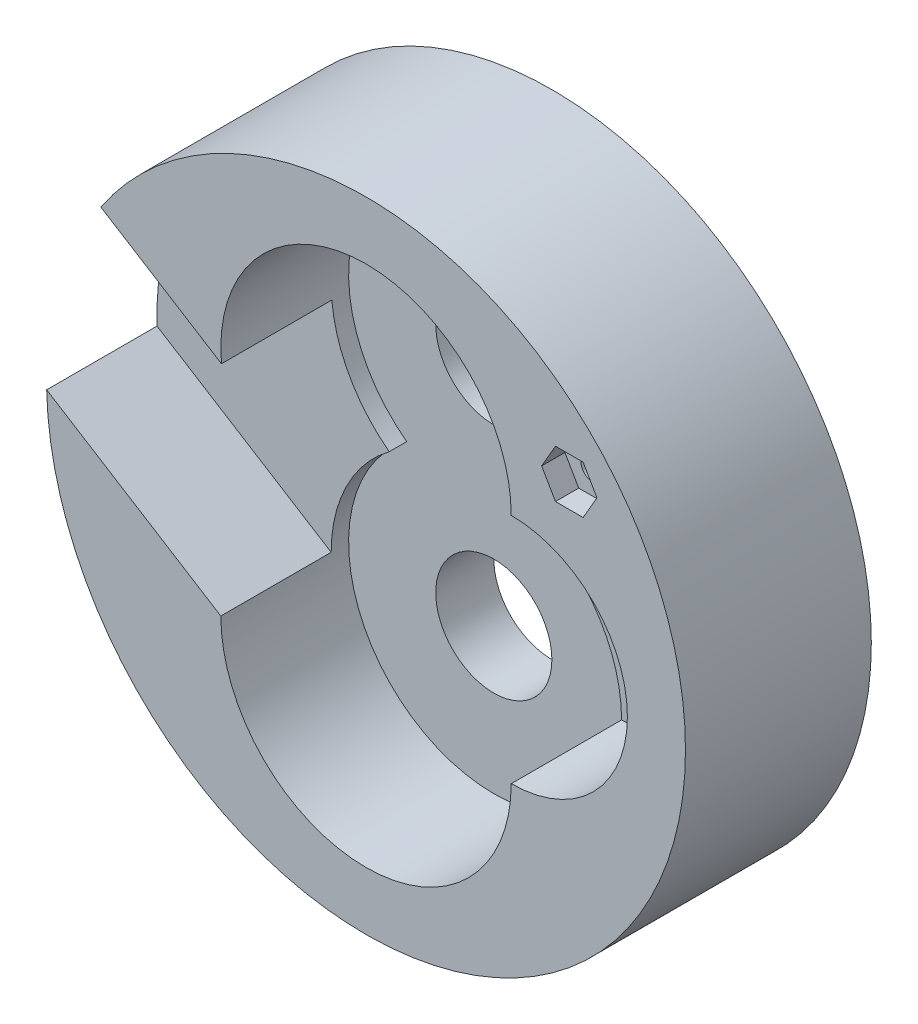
ISO-10303-21;
HEADER;
FILE_DESCRIPTION(('STEP AP214'),'2;1');
FILE_NAME('part.step','',(''),(''),'','','');
FILE_SCHEMA(('AUTOMOTIVE_DESIGN { 1 0 10303 214 1 1 1 1 }'));
ENDSEC;
DATA;
#1=APPLICATION_CONTEXT('core data for automotive mechanical design processes');
#2=APPLICATION_PROTOCOL_DEFINITION('international standard','automotive_design',2000,#1);
#3=PRODUCT_CONTEXT('',#1,'mechanical');
#4=PRODUCT('Part','Part','',(#3));
#5=PRODUCT_RELATED_PRODUCT_CATEGORY('part','',(#4));
#6=PRODUCT_DEFINITION_FORMATION('','',#4);
#7=PRODUCT_DEFINITION_CONTEXT('part definition',#1,'design');
#8=PRODUCT_DEFINITION('design','',#6,#7);
#9=PRODUCT_DEFINITION_SHAPE('','',#8);
#10=(LENGTH_UNIT() NAMED_UNIT(*) SI_UNIT(.MILLI.,.METRE.));
#11=(NAMED_UNIT(*) PLANE_ANGLE_UNIT() SI_UNIT($,.RADIAN.));
#12=(NAMED_UNIT(*) SI_UNIT($,.STERADIAN.) SOLID_ANGLE_UNIT());
#13=UNCERTAINTY_MEASURE_WITH_UNIT(LENGTH_MEASURE(1.E-05),#10,'distance_accuracy_value','');
#14=(GEOMETRIC_REPRESENTATION_CONTEXT(3) GLOBAL_UNCERTAINTY_ASSIGNED_CONTEXT((#13)) GLOBAL_UNIT_ASSIGNED_CONTEXT((#10,
#11,#12)) REPRESENTATION_CONTEXT('',''));
#15=CARTESIAN_POINT('',(0.,0.,0.));
#16=DIRECTION('',(0.,0.,1.));
#17=DIRECTION('',(1.,0.,0.));
#18=AXIS2_PLACEMENT_3D('',#15,#16,#17);
#19=CARTESIAN_POINT('',(0.,20.,-22.));
#20=DIRECTION('',(0.,0.,1.));
#21=DIRECTION('',(1.,0.,0.));
#22=AXIS2_PLACEMENT_3D('',#19,#20,#21);
#23=CYLINDRICAL_SURFACE('',#22,25.);
#24=DIRECTION('',(0.,0.,1.));
#25=VECTOR('',#24,1.);
#26=CARTESIAN_POINT('',(25.,20.,-19.));
#27=LINE('',#26,#25);
#28=CARTESIAN_POINT('',(25.,20.,-19.));
#29=VERTEX_POINT('',#28);
#30=CARTESIAN_POINT('',(25.,20.,0.));
#31=VERTEX_POINT('',#30);
#32=EDGE_CURVE('E196',#29,#31,#27,.T.);
#33=ORIENTED_EDGE('',*,*,#32,.T.);
#34=CARTESIAN_POINT('',(0.,20.,0.));
#35=DIRECTION('',(0.,0.,1.));
#36=DIRECTION('',(1.,0.,0.));
#37=AXIS2_PLACEMENT_3D('',#34,#35,#36);
#38=CIRCLE('',#37,25.);
#39=CARTESIAN_POINT('',(-24.8907586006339,17.6654473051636,0.));
#40=VERTEX_POINT('',#39);
#41=EDGE_CURVE('E241',#31,#40,#38,.T.);
#42=ORIENTED_EDGE('',*,*,#41,.T.);
#43=DIRECTION('',(0.,0.,1.));
#44=VECTOR('',#43,1.);
#45=CARTESIAN_POINT('',(-24.8907586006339,17.6654473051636,-19.));
#46=LINE('',#45,#44);
#47=CARTESIAN_POINT('',(-24.8907586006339,17.6654473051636,-19.));
#48=VERTEX_POINT('',#47);
#49=EDGE_CURVE('E218',#48,#40,#46,.T.);
#50=ORIENTED_EDGE('',*,*,#49,.F.);
#51=CARTESIAN_POINT('',(0.,20.,-19.));
#52=DIRECTION('',(0.,0.,1.));
#53=DIRECTION('',(1.,0.,0.));
#54=AXIS2_PLACEMENT_3D('',#51,#52,#53);
#55=CIRCLE('',#54,25.);
#56=CARTESIAN_POINT('',(-15.,0.,-19.));
#57=VERTEX_POINT('',#56);
#58=EDGE_CURVE('E209',#48,#57,#55,.T.);
#59=ORIENTED_EDGE('',*,*,#58,.T.);
#60=DIRECTION('',(0.,0.,1.));
#61=VECTOR('',#60,1.);
#62=CARTESIAN_POINT('',(-15.,0.,-22.));
#63=LINE('',#62,#61);
#64=CARTESIAN_POINT('',(-15.,0.,-22.));
#65=VERTEX_POINT('',#64);
#66=EDGE_CURVE('E252',#65,#57,#63,.T.);
#67=ORIENTED_EDGE('',*,*,#66,.F.);
#68=CARTESIAN_POINT('',(0.,20.,-22.));
#69=DIRECTION('',(0.,0.,1.));
#70=DIRECTION('',(1.,0.,0.));
#71=AXIS2_PLACEMENT_3D('',#68,#69,#70);
#72=CIRCLE('',#71,25.);
#73=CARTESIAN_POINT('',(15.,0.,-22.));
#74=VERTEX_POINT('',#73);
#75=EDGE_CURVE('E246',#74,#65,#72,.T.);
#76=ORIENTED_EDGE('',*,*,#75,.F.);
#77=DIRECTION('',(0.,0.,1.));
#78=VECTOR('',#77,1.);
#79=CARTESIAN_POINT('',(15.,0.,-22.));
#80=LINE('',#79,#78);
#81=CARTESIAN_POINT('',(15.,0.,-19.));
#82=VERTEX_POINT('',#81);
#83=EDGE_CURVE('E253',#74,#82,#80,.T.);
#84=ORIENTED_EDGE('',*,*,#83,.T.);
#85=CARTESIAN_POINT('',(0.,20.,-19.));
#86=DIRECTION('',(0.,0.,1.));
#87=DIRECTION('',(1.,0.,0.));
#88=AXIS2_PLACEMENT_3D('',#85,#86,#87);
#89=CIRCLE('',#88,25.);
#90=EDGE_CURVE('E51',#82,#29,#89,.T.);
#91=ORIENTED_EDGE('',*,*,#90,.T.);
#92=EDGE_LOOP('',(#33,#42,#50,#59,#67,#76,#84,#91));
#93=FACE_BOUND('',#92,.T.);
#94=ADVANCED_FACE('F28',(#93),#23,.F.);
#95=CARTESIAN_POINT('',(0.,0.,0.));
#96=DIRECTION('',(0.,0.,1.));
#97=DIRECTION('',(1.,0.,0.));
#98=AXIS2_PLACEMENT_3D('',#95,#96,#97);
#99=PLANE('',#98);
#100=DIRECTION('',(1.,0.,0.));
#101=VECTOR('',#100,1.);
#102=CARTESIAN_POINT('',(32.6184301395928,25.875,0.));
#103=LINE('',#102,#101);
#104=CARTESIAN_POINT('',(32.6184301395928,25.875,0.));
#105=VERTEX_POINT('',#104);
#106=CARTESIAN_POINT('',(37.3815698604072,25.875,0.));
#107=VERTEX_POINT('',#106);
#108=EDGE_CURVE('E43',#105,#107,#103,.T.);
#109=ORIENTED_EDGE('',*,*,#108,.F.);
#110=DIRECTION('',(0.500000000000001,-0.866025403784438,0.));
#111=VECTOR('',#110,1.);
#112=CARTESIAN_POINT('',(30.2368602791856,30.,0.));
#113=LINE('',#112,#111);
#114=CARTESIAN_POINT('',(30.2368602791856,30.,0.));
#115=VERTEX_POINT('',#114);
#116=EDGE_CURVE('E161',#115,#105,#113,.T.);
#117=ORIENTED_EDGE('',*,*,#116,.F.);
#118=DIRECTION('',(-0.500000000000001,-0.866025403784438,0.));
#119=VECTOR('',#118,1.);
#120=CARTESIAN_POINT('',(32.6184301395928,34.125,0.));
#121=LINE('',#120,#119);
#122=CARTESIAN_POINT('',(32.6184301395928,34.125,0.));
#123=VERTEX_POINT('',#122);
#124=EDGE_CURVE('E155',#123,#115,#121,.T.);
#125=ORIENTED_EDGE('',*,*,#124,.F.);
#126=DIRECTION('',(-1.,0.,0.));
#127=VECTOR('',#126,1.);
#128=CARTESIAN_POINT('',(37.3815698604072,34.125,0.));
#129=LINE('',#128,#127);
#130=CARTESIAN_POINT('',(37.3815698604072,34.125,0.));
#131=VERTEX_POINT('',#130);
#132=EDGE_CURVE('E153',#131,#123,#129,.T.);
#133=ORIENTED_EDGE('',*,*,#132,.F.);
#134=DIRECTION('',(-0.500000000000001,0.866025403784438,0.));
#135=VECTOR('',#134,1.);
#136=CARTESIAN_POINT('',(39.7631397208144,30.,0.));
#137=LINE('',#136,#135);
#138=CARTESIAN_POINT('',(39.7631397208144,30.,0.));
#139=VERTEX_POINT('',#138);
#140=EDGE_CURVE('E134',#139,#131,#137,.T.);
#141=ORIENTED_EDGE('',*,*,#140,.F.);
#142=DIRECTION('',(0.500000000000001,0.866025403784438,0.));
#143=VECTOR('',#142,1.);
#144=CARTESIAN_POINT('',(37.3815698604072,25.875,0.));
#145=LINE('',#144,#143);
#146=EDGE_CURVE('E145',#107,#139,#145,.T.);
#147=ORIENTED_EDGE('',*,*,#146,.F.);
#148=EDGE_LOOP('',(#109,#117,#125,#133,#141,#147));
#149=FACE_BOUND('',#148,.T.);
#150=ORIENTED_EDGE('',*,*,#41,.F.);
#151=CARTESIAN_POINT('',(25.,0.,0.));
#152=DIRECTION('',(0.,0.,1.));
#153=DIRECTION('',(1.,0.,0.));
#154=AXIS2_PLACEMENT_3D('',#151,#152,#153);
#155=CIRCLE('',#154,20.);
#156=CARTESIAN_POINT('',(25.,-20.,0.));
#157=VERTEX_POINT('',#156);
#158=EDGE_CURVE('E181',#31,#157,#155,.F.);
#159=ORIENTED_EDGE('',*,*,#158,.T.);
#160=CARTESIAN_POINT('',(0.,-20.,0.));
#161=DIRECTION('',(0.,0.,1.));
#162=DIRECTION('',(1.,0.,0.));
#163=AXIS2_PLACEMENT_3D('',#160,#161,#162);
#164=CIRCLE('',#163,25.);
#165=CARTESIAN_POINT('',(-25.,-20.,0.));
#166=VERTEX_POINT('',#165);
#167=EDGE_CURVE('E243',#166,#157,#164,.T.);
#168=ORIENTED_EDGE('',*,*,#167,.F.);
#169=DIRECTION('',(0.848048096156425,-0.529919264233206,0.));
#170=VECTOR('',#169,1.);
#171=CARTESIAN_POINT('',(38.4322930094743,-59.6368958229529,0.));
#172=LINE('',#171,#170);
#173=CARTESIAN_POINT('',(-54.9854969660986,-1.26298194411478,0.));
#174=VERTEX_POINT('',#173);
#175=EDGE_CURVE('E204',#174,#166,#172,.T.);
#176=ORIENTED_EDGE('',*,*,#175,.F.);
#177=CARTESIAN_POINT('',(0.,0.,0.));
#178=DIRECTION('',(0.,0.,1.));
#179=DIRECTION('',(1.,0.,0.));
#180=AXIS2_PLACEMENT_3D('',#177,#178,#179);
#181=CIRCLE('',#180,55.);
#182=CARTESIAN_POINT('',(-45.6687921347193,30.6490036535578,0.));
#183=VERTEX_POINT('',#182);
#184=EDGE_CURVE('E36',#174,#183,#181,.T.);
#185=ORIENTED_EDGE('',*,*,#184,.T.);
#186=DIRECTION('',(0.848048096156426,-0.529919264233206,0.));
#187=VECTOR('',#186,1.);
#188=CARTESIAN_POINT('',(55.3897094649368,-32.4993567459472,0.));
#189=LINE('',#188,#187);
#190=EDGE_CURVE('E199',#183,#40,#189,.T.);
#191=ORIENTED_EDGE('',*,*,#190,.T.);
#192=EDGE_LOOP('',(#150,#159,#168,#176,#185,#191));
#193=FACE_BOUND('',#192,.T.);
#194=ADVANCED_FACE('F149',(#149,#193),#99,.T.);
#195=CARTESIAN_POINT('',(0.,-20.,-22.));
#196=DIRECTION('',(0.,0.,1.));
#197=DIRECTION('',(1.,0.,0.));
#198=AXIS2_PLACEMENT_3D('',#195,#196,#197);
#199=CYLINDRICAL_SURFACE('',#198,25.);
#200=DIRECTION('',(0.,0.,1.));
#201=VECTOR('',#200,1.);
#202=CARTESIAN_POINT('',(25.,-20.,-19.));
#203=LINE('',#202,#201);
#204=CARTESIAN_POINT('',(25.,-20.,-19.));
#205=VERTEX_POINT('',#204);
#206=EDGE_CURVE('E197',#205,#157,#203,.T.);
#207=ORIENTED_EDGE('',*,*,#206,.F.);
#208=CARTESIAN_POINT('',(0.,-20.,-19.));
#209=DIRECTION('',(0.,0.,1.));
#210=DIRECTION('',(1.,0.,0.));
#211=AXIS2_PLACEMENT_3D('',#208,#209,#210);
#212=CIRCLE('',#211,25.);
#213=EDGE_CURVE('E194',#205,#82,#212,.T.);
#214=ORIENTED_EDGE('',*,*,#213,.T.);
#215=ORIENTED_EDGE('',*,*,#83,.F.);
#216=CARTESIAN_POINT('',(0.,-20.,-22.));
#217=DIRECTION('',(0.,0.,1.));
#218=DIRECTION('',(1.,0.,0.));
#219=AXIS2_PLACEMENT_3D('',#216,#217,#218);
#220=CIRCLE('',#219,25.);
#221=EDGE_CURVE('E249',#65,#74,#220,.T.);
#222=ORIENTED_EDGE('',*,*,#221,.F.);
#223=ORIENTED_EDGE('',*,*,#66,.T.);
#224=CARTESIAN_POINT('',(0.,-20.,-19.));
#225=DIRECTION('',(0.,0.,1.));
#226=DIRECTION('',(1.,0.,0.));
#227=AXIS2_PLACEMENT_3D('',#224,#225,#226);
#228=CIRCLE('',#227,25.);
#229=CARTESIAN_POINT('',(-25.,-20.,-19.));
#230=VERTEX_POINT('',#229);
#231=EDGE_CURVE('E206',#57,#230,#228,.T.);
#232=ORIENTED_EDGE('',*,*,#231,.T.);
#233=DIRECTION('',(0.,0.,1.));
#234=VECTOR('',#233,1.);
#235=CARTESIAN_POINT('',(-25.,-20.,-19.));
#236=LINE('',#235,#234);
#237=EDGE_CURVE('E219',#230,#166,#236,.T.);
#238=ORIENTED_EDGE('',*,*,#237,.T.);
#239=ORIENTED_EDGE('',*,*,#167,.T.);
#240=EDGE_LOOP('',(#207,#214,#215,#222,#223,#232,#238,#239));
#241=FACE_BOUND('',#240,.T.);
#242=ADVANCED_FACE('F278',(#241),#199,.F.);
#243=CARTESIAN_POINT('',(0.,0.,-32.));
#244=DIRECTION('',(0.,0.,1.));
#245=DIRECTION('',(1.,0.,0.));
#246=AXIS2_PLACEMENT_3D('',#243,#244,#245);
#247=CYLINDRICAL_SURFACE('',#246,55.);
#248=DIRECTION('',(0.,0.,1.));
#249=VECTOR('',#248,1.);
#250=CARTESIAN_POINT('',(-54.9854969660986,-1.26298194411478,-19.));
#251=LINE('',#250,#249);
#252=CARTESIAN_POINT('',(-54.9854969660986,-1.26298194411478,-19.));
#253=VERTEX_POINT('',#252);
#254=EDGE_CURVE('E223',#253,#174,#251,.T.);
#255=ORIENTED_EDGE('',*,*,#254,.F.);
#256=CARTESIAN_POINT('',(0.,0.,-19.));
#257=DIRECTION('',(0.,0.,1.));
#258=DIRECTION('',(1.,0.,0.));
#259=AXIS2_PLACEMENT_3D('',#256,#257,#258);
#260=CIRCLE('',#259,55.);
#261=CARTESIAN_POINT('',(-45.6687921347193,30.6490036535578,-19.));
#262=VERTEX_POINT('',#261);
#263=EDGE_CURVE('E214',#262,#253,#260,.T.);
#264=ORIENTED_EDGE('',*,*,#263,.F.);
#265=DIRECTION('',(0.,0.,1.));
#266=VECTOR('',#265,1.);
#267=CARTESIAN_POINT('',(-45.6687921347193,30.6490036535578,-19.));
#268=LINE('',#267,#266);
#269=EDGE_CURVE('E225',#262,#183,#268,.T.);
#270=ORIENTED_EDGE('',*,*,#269,.T.);
#271=ORIENTED_EDGE('',*,*,#184,.F.);
#272=EDGE_LOOP('',(#255,#264,#270,#271));
#273=FACE_BOUND('',#272,.T.);
#274=CARTESIAN_POINT('',(0.,0.,-32.));
#275=DIRECTION('',(0.,0.,1.));
#276=DIRECTION('',(1.,0.,0.));
#277=AXIS2_PLACEMENT_3D('',#274,#275,#276);
#278=CIRCLE('',#277,55.);
#279=CARTESIAN_POINT('',(55.,0.,-32.));
#280=VERTEX_POINT('',#279);
#281=EDGE_CURVE('E11',#280,#280,#278,.T.);
#282=ORIENTED_EDGE('',*,*,#281,.T.);
#283=EDGE_LOOP('',(#282));
#284=FACE_BOUND('',#283,.T.);
#285=ADVANCED_FACE('F30',(#273,#284),#247,.T.);
#286=CARTESIAN_POINT('',(0.,0.,-32.));
#287=DIRECTION('',(0.,0.,1.));
#288=DIRECTION('',(1.,0.,0.));
#289=AXIS2_PLACEMENT_3D('',#286,#287,#288);
#290=PLANE('',#289);
#291=CARTESIAN_POINT('',(35.,30.,-32.));
#292=DIRECTION('',(0.,0.,1.));
#293=DIRECTION('',(1.,0.,0.));
#294=AXIS2_PLACEMENT_3D('',#291,#292,#293);
#295=CIRCLE('',#294,2.);
#296=CARTESIAN_POINT('',(37.,30.,-32.));
#297=VERTEX_POINT('',#296);
#298=EDGE_CURVE('E317',#297,#297,#295,.T.);
#299=ORIENTED_EDGE('',*,*,#298,.T.);
#300=EDGE_LOOP('',(#299));
#301=FACE_BOUND('',#300,.T.);
#302=CARTESIAN_POINT('',(0.,-20.,-32.));
#303=DIRECTION('',(0.,0.,1.));
#304=DIRECTION('',(1.,0.,0.));
#305=AXIS2_PLACEMENT_3D('',#302,#303,#304);
#306=CIRCLE('',#305,10.);
#307=CARTESIAN_POINT('',(10.,-20.,-32.));
#308=VERTEX_POINT('',#307);
#309=EDGE_CURVE('E222',#308,#308,#306,.T.);
#310=ORIENTED_EDGE('',*,*,#309,.T.);
#311=EDGE_LOOP('',(#310));
#312=FACE_BOUND('',#311,.T.);
#313=CARTESIAN_POINT('',(0.,20.,-32.));
#314=DIRECTION('',(0.,0.,1.));
#315=DIRECTION('',(1.,0.,0.));
#316=AXIS2_PLACEMENT_3D('',#313,#314,#315);
#317=CIRCLE('',#316,10.);
#318=CARTESIAN_POINT('',(10.,20.,-32.));
#319=VERTEX_POINT('',#318);
#320=EDGE_CURVE('E235',#319,#319,#317,.T.);
#321=ORIENTED_EDGE('',*,*,#320,.T.);
#322=EDGE_LOOP('',(#321));
#323=FACE_BOUND('',#322,.T.);
#324=ORIENTED_EDGE('',*,*,#281,.F.);
#325=EDGE_LOOP('',(#324));
#326=FACE_BOUND('',#325,.T.);
#327=ADVANCED_FACE('F304',(#301,#312,#323,#326),#290,.F.);
#328=CARTESIAN_POINT('',(0.,-121.141421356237,-22.));
#329=DIRECTION('',(0.,0.,1.));
#330=DIRECTION('',(1.,0.,0.));
#331=AXIS2_PLACEMENT_3D('',#328,#329,#330);
#332=PLANE('',#331);
#333=CARTESIAN_POINT('',(0.,-20.,-22.));
#334=DIRECTION('',(0.,0.,1.));
#335=DIRECTION('',(1.,0.,0.));
#336=AXIS2_PLACEMENT_3D('',#333,#334,#335);
#337=CIRCLE('',#336,10.);
#338=CARTESIAN_POINT('',(10.,-20.,-22.));
#339=VERTEX_POINT('',#338);
#340=EDGE_CURVE('E232',#339,#339,#337,.T.);
#341=ORIENTED_EDGE('',*,*,#340,.F.);
#342=EDGE_LOOP('',(#341));
#343=FACE_BOUND('',#342,.T.);
#344=CARTESIAN_POINT('',(0.,20.,-22.));
#345=DIRECTION('',(0.,0.,1.));
#346=DIRECTION('',(1.,0.,0.));
#347=AXIS2_PLACEMENT_3D('',#344,#345,#346);
#348=CIRCLE('',#347,10.);
#349=CARTESIAN_POINT('',(10.,20.,-22.));
#350=VERTEX_POINT('',#349);
#351=EDGE_CURVE('E238',#350,#350,#348,.T.);
#352=ORIENTED_EDGE('',*,*,#351,.F.);
#353=EDGE_LOOP('',(#352));
#354=FACE_BOUND('',#353,.T.);
#355=ORIENTED_EDGE('',*,*,#75,.T.);
#356=ORIENTED_EDGE('',*,*,#221,.T.);
#357=EDGE_LOOP('',(#355,#356));
#358=FACE_BOUND('',#357,.T.);
#359=ADVANCED_FACE('F306',(#343,#354,#358),#332,.T.);
#360=CARTESIAN_POINT('',(0.,20.,-32.));
#361=DIRECTION('',(0.,0.,1.));
#362=DIRECTION('',(1.,0.,0.));
#363=AXIS2_PLACEMENT_3D('',#360,#361,#362);
#364=CYLINDRICAL_SURFACE('',#363,10.);
#365=ORIENTED_EDGE('',*,*,#351,.T.);
#366=EDGE_LOOP('',(#365));
#367=FACE_BOUND('',#366,.T.);
#368=ORIENTED_EDGE('',*,*,#320,.F.);
#369=EDGE_LOOP('',(#368));
#370=FACE_BOUND('',#369,.T.);
#371=ADVANCED_FACE('F291',(#367,#370),#364,.F.);
#372=CARTESIAN_POINT('',(0.,-20.,-32.));
#373=DIRECTION('',(0.,0.,1.));
#374=DIRECTION('',(1.,0.,0.));
#375=AXIS2_PLACEMENT_3D('',#372,#373,#374);
#376=CYLINDRICAL_SURFACE('',#375,10.);
#377=ORIENTED_EDGE('',*,*,#340,.T.);
#378=EDGE_LOOP('',(#377));
#379=FACE_BOUND('',#378,.T.);
#380=ORIENTED_EDGE('',*,*,#309,.F.);
#381=EDGE_LOOP('',(#380));
#382=FACE_BOUND('',#381,.T.);
#383=ADVANCED_FACE('F283',(#379,#382),#376,.F.);
#384=CARTESIAN_POINT('',(38.4322930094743,-59.6368958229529,-19.));
#385=DIRECTION('',(-0.529919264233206,-0.848048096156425,0.));
#386=DIRECTION('',(0.848048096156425,-0.529919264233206,0.));
#387=AXIS2_PLACEMENT_3D('',#384,#385,#386);
#388=PLANE('',#387);
#389=ORIENTED_EDGE('',*,*,#175,.T.);
#390=ORIENTED_EDGE('',*,*,#237,.F.);
#391=DIRECTION('',(0.848048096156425,-0.529919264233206,0.));
#392=VECTOR('',#391,1.);
#393=CARTESIAN_POINT('',(38.4322930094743,-59.6368958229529,-19.));
#394=LINE('',#393,#392);
#395=EDGE_CURVE('E216',#253,#230,#394,.T.);
#396=ORIENTED_EDGE('',*,*,#395,.F.);
#397=ORIENTED_EDGE('',*,*,#254,.T.);
#398=EDGE_LOOP('',(#389,#390,#396,#397));
#399=FACE_BOUND('',#398,.T.);
#400=ADVANCED_FACE('F281',(#399),#388,.F.);
#401=CARTESIAN_POINT('',(55.3897094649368,-32.4993567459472,-19.));
#402=DIRECTION('',(-0.529919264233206,-0.848048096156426,0.));
#403=DIRECTION('',(0.848048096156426,-0.529919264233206,0.));
#404=AXIS2_PLACEMENT_3D('',#401,#402,#403);
#405=PLANE('',#404);
#406=ORIENTED_EDGE('',*,*,#190,.F.);
#407=ORIENTED_EDGE('',*,*,#269,.F.);
#408=DIRECTION('',(0.848048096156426,-0.529919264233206,0.));
#409=VECTOR('',#408,1.);
#410=CARTESIAN_POINT('',(55.3897094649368,-32.4993567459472,-19.));
#411=LINE('',#410,#409);
#412=EDGE_CURVE('E212',#262,#48,#411,.T.);
#413=ORIENTED_EDGE('',*,*,#412,.T.);
#414=ORIENTED_EDGE('',*,*,#49,.T.);
#415=EDGE_LOOP('',(#406,#407,#413,#414));
#416=FACE_BOUND('',#415,.T.);
#417=ADVANCED_FACE('F268',(#416),#405,.T.);
#418=CARTESIAN_POINT('',(0.,-121.141421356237,-19.));
#419=DIRECTION('',(0.,0.,1.));
#420=DIRECTION('',(1.,0.,0.));
#421=AXIS2_PLACEMENT_3D('',#418,#419,#420);
#422=PLANE('',#421);
#423=ORIENTED_EDGE('',*,*,#231,.F.);
#424=ORIENTED_EDGE('',*,*,#58,.F.);
#425=ORIENTED_EDGE('',*,*,#412,.F.);
#426=ORIENTED_EDGE('',*,*,#263,.T.);
#427=ORIENTED_EDGE('',*,*,#395,.T.);
#428=EDGE_LOOP('',(#423,#424,#425,#426,#427));
#429=FACE_BOUND('',#428,.T.);
#430=ADVANCED_FACE('F271',(#429),#422,.T.);
#431=CARTESIAN_POINT('',(25.,0.,-19.));
#432=DIRECTION('',(0.,0.,1.));
#433=DIRECTION('',(1.,0.,0.));
#434=AXIS2_PLACEMENT_3D('',#431,#432,#433);
#435=CYLINDRICAL_SURFACE('',#434,20.);
#436=ORIENTED_EDGE('',*,*,#158,.F.);
#437=ORIENTED_EDGE('',*,*,#32,.F.);
#438=CARTESIAN_POINT('',(25.,0.,-19.));
#439=DIRECTION('',(0.,0.,1.));
#440=DIRECTION('',(1.,0.,0.));
#441=AXIS2_PLACEMENT_3D('',#438,#439,#440);
#442=CIRCLE('',#441,20.);
#443=EDGE_CURVE('E190',#29,#205,#442,.F.);
#444=ORIENTED_EDGE('',*,*,#443,.T.);
#445=ORIENTED_EDGE('',*,*,#206,.T.);
#446=EDGE_LOOP('',(#436,#437,#444,#445));
#447=FACE_BOUND('',#446,.T.);
#448=ADVANCED_FACE('F335',(#447),#435,.F.);
#449=CARTESIAN_POINT('',(0.,-121.141421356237,-19.));
#450=DIRECTION('',(0.,0.,1.));
#451=DIRECTION('',(1.,0.,0.));
#452=AXIS2_PLACEMENT_3D('',#449,#450,#451);
#453=PLANE('',#452);
#454=ORIENTED_EDGE('',*,*,#443,.F.);
#455=ORIENTED_EDGE('',*,*,#90,.F.);
#456=ORIENTED_EDGE('',*,*,#213,.F.);
#457=EDGE_LOOP('',(#454,#455,#456));
#458=FACE_BOUND('',#457,.T.);
#459=ADVANCED_FACE('F334',(#458),#453,.T.);
#460=CARTESIAN_POINT('',(32.6184301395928,25.875,-4.));
#461=DIRECTION('',(0.,-1.,0.));
#462=DIRECTION('',(0.,0.,-1.));
#463=AXIS2_PLACEMENT_3D('',#460,#461,#462);
#464=PLANE('',#463);
#465=ORIENTED_EDGE('',*,*,#108,.T.);
#466=DIRECTION('',(0.,0.,1.));
#467=VECTOR('',#466,1.);
#468=CARTESIAN_POINT('',(37.3815698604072,25.875,-4.));
#469=LINE('',#468,#467);
#470=CARTESIAN_POINT('',(37.3815698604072,25.875,-4.));
#471=VERTEX_POINT('',#470);
#472=EDGE_CURVE('E142',#471,#107,#469,.T.);
#473=ORIENTED_EDGE('',*,*,#472,.F.);
#474=DIRECTION('',(1.,0.,0.));
#475=VECTOR('',#474,1.);
#476=CARTESIAN_POINT('',(32.6184301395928,25.875,-4.));
#477=LINE('',#476,#475);
#478=CARTESIAN_POINT('',(32.6184301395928,25.875,-4.));
#479=VERTEX_POINT('',#478);
#480=EDGE_CURVE('E164',#479,#471,#477,.T.);
#481=ORIENTED_EDGE('',*,*,#480,.F.);
#482=DIRECTION('',(0.,0.,1.));
#483=VECTOR('',#482,1.);
#484=CARTESIAN_POINT('',(32.6184301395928,25.875,-4.));
#485=LINE('',#484,#483);
#486=EDGE_CURVE('E179',#479,#105,#485,.T.);
#487=ORIENTED_EDGE('',*,*,#486,.T.);
#488=EDGE_LOOP('',(#465,#473,#481,#487));
#489=FACE_BOUND('',#488,.T.);
#490=ADVANCED_FACE('F342',(#489),#464,.F.);
#491=CARTESIAN_POINT('',(30.2368602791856,30.,-4.));
#492=DIRECTION('',(-0.866025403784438,-0.500000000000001,0.));
#493=DIRECTION('',(0.500000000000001,-0.866025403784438,0.));
#494=AXIS2_PLACEMENT_3D('',#491,#492,#493);
#495=PLANE('',#494);
#496=ORIENTED_EDGE('',*,*,#116,.T.);
#497=ORIENTED_EDGE('',*,*,#486,.F.);
#498=DIRECTION('',(0.500000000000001,-0.866025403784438,0.));
#499=VECTOR('',#498,1.);
#500=CARTESIAN_POINT('',(30.2368602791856,30.,-4.));
#501=LINE('',#500,#499);
#502=CARTESIAN_POINT('',(30.2368602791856,30.,-4.));
#503=VERTEX_POINT('',#502);
#504=EDGE_CURVE('E176',#503,#479,#501,.T.);
#505=ORIENTED_EDGE('',*,*,#504,.F.);
#506=DIRECTION('',(0.,0.,1.));
#507=VECTOR('',#506,1.);
#508=CARTESIAN_POINT('',(30.2368602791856,30.,-4.));
#509=LINE('',#508,#507);
#510=EDGE_CURVE('E182',#503,#115,#509,.T.);
#511=ORIENTED_EDGE('',*,*,#510,.T.);
#512=EDGE_LOOP('',(#496,#497,#505,#511));
#513=FACE_BOUND('',#512,.T.);
#514=ADVANCED_FACE('F347',(#513),#495,.F.);
#515=CARTESIAN_POINT('',(32.6184301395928,34.125,-4.));
#516=DIRECTION('',(-0.866025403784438,0.500000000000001,0.));
#517=DIRECTION('',(-0.500000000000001,-0.866025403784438,0.));
#518=AXIS2_PLACEMENT_3D('',#515,#516,#517);
#519=PLANE('',#518);
#520=ORIENTED_EDGE('',*,*,#124,.T.);
#521=ORIENTED_EDGE('',*,*,#510,.F.);
#522=DIRECTION('',(-0.500000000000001,-0.866025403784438,0.));
#523=VECTOR('',#522,1.);
#524=CARTESIAN_POINT('',(32.6184301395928,34.125,-4.));
#525=LINE('',#524,#523);
#526=CARTESIAN_POINT('',(32.6184301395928,34.125,-4.));
#527=VERTEX_POINT('',#526);
#528=EDGE_CURVE('E173',#527,#503,#525,.T.);
#529=ORIENTED_EDGE('',*,*,#528,.F.);
#530=DIRECTION('',(0.,0.,1.));
#531=VECTOR('',#530,1.);
#532=CARTESIAN_POINT('',(32.6184301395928,34.125,-4.));
#533=LINE('',#532,#531);
#534=EDGE_CURVE('E184',#527,#123,#533,.T.);
#535=ORIENTED_EDGE('',*,*,#534,.T.);
#536=EDGE_LOOP('',(#520,#521,#529,#535));
#537=FACE_BOUND('',#536,.T.);
#538=ADVANCED_FACE('F355',(#537),#519,.F.);
#539=CARTESIAN_POINT('',(37.3815698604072,34.125,-4.));
#540=DIRECTION('',(0.,1.,0.));
#541=DIRECTION('',(0.,0.,1.));
#542=AXIS2_PLACEMENT_3D('',#539,#540,#541);
#543=PLANE('',#542);
#544=ORIENTED_EDGE('',*,*,#132,.T.);
#545=ORIENTED_EDGE('',*,*,#534,.F.);
#546=DIRECTION('',(-1.,0.,0.));
#547=VECTOR('',#546,1.);
#548=CARTESIAN_POINT('',(37.3815698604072,34.125,-4.));
#549=LINE('',#548,#547);
#550=CARTESIAN_POINT('',(37.3815698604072,34.125,-4.));
#551=VERTEX_POINT('',#550);
#552=EDGE_CURVE('E170',#551,#527,#549,.T.);
#553=ORIENTED_EDGE('',*,*,#552,.F.);
#554=DIRECTION('',(0.,0.,1.));
#555=VECTOR('',#554,1.);
#556=CARTESIAN_POINT('',(37.3815698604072,34.125,-4.));
#557=LINE('',#556,#555);
#558=EDGE_CURVE('E141',#551,#131,#557,.T.);
#559=ORIENTED_EDGE('',*,*,#558,.T.);
#560=EDGE_LOOP('',(#544,#545,#553,#559));
#561=FACE_BOUND('',#560,.T.);
#562=ADVANCED_FACE('F352',(#561),#543,.F.);
#563=CARTESIAN_POINT('',(39.7631397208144,30.,-4.));
#564=DIRECTION('',(0.866025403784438,0.500000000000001,0.));
#565=DIRECTION('',(-0.500000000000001,0.866025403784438,0.));
#566=AXIS2_PLACEMENT_3D('',#563,#564,#565);
#567=PLANE('',#566);
#568=ORIENTED_EDGE('',*,*,#140,.T.);
#569=ORIENTED_EDGE('',*,*,#558,.F.);
#570=DIRECTION('',(-0.500000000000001,0.866025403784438,0.));
#571=VECTOR('',#570,1.);
#572=CARTESIAN_POINT('',(39.7631397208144,30.,-4.));
#573=LINE('',#572,#571);
#574=CARTESIAN_POINT('',(39.7631397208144,30.,-4.));
#575=VERTEX_POINT('',#574);
#576=EDGE_CURVE('E137',#575,#551,#573,.T.);
#577=ORIENTED_EDGE('',*,*,#576,.F.);
#578=DIRECTION('',(0.,0.,1.));
#579=VECTOR('',#578,1.);
#580=CARTESIAN_POINT('',(39.7631397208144,30.,-4.));
#581=LINE('',#580,#579);
#582=EDGE_CURVE('E130',#575,#139,#581,.T.);
#583=ORIENTED_EDGE('',*,*,#582,.T.);
#584=EDGE_LOOP('',(#568,#569,#577,#583));
#585=FACE_BOUND('',#584,.T.);
#586=ADVANCED_FACE('F132',(#585),#567,.F.);
#587=CARTESIAN_POINT('',(37.3815698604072,25.875,-4.));
#588=DIRECTION('',(0.866025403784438,-0.500000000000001,0.));
#589=DIRECTION('',(0.500000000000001,0.866025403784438,0.));
#590=AXIS2_PLACEMENT_3D('',#587,#588,#589);
#591=PLANE('',#590);
#592=ORIENTED_EDGE('',*,*,#146,.T.);
#593=ORIENTED_EDGE('',*,*,#582,.F.);
#594=DIRECTION('',(0.500000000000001,0.866025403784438,0.));
#595=VECTOR('',#594,1.);
#596=CARTESIAN_POINT('',(37.3815698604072,25.875,-4.));
#597=LINE('',#596,#595);
#598=EDGE_CURVE('E167',#471,#575,#597,.T.);
#599=ORIENTED_EDGE('',*,*,#598,.F.);
#600=ORIENTED_EDGE('',*,*,#472,.T.);
#601=EDGE_LOOP('',(#592,#593,#599,#600));
#602=FACE_BOUND('',#601,.T.);
#603=ADVANCED_FACE('F146',(#602),#591,.F.);
#604=CARTESIAN_POINT('',(32.6184301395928,25.875,-4.));
#605=DIRECTION('',(0.,0.,-1.));
#606=DIRECTION('',(-1.,0.,0.));
#607=AXIS2_PLACEMENT_3D('',#604,#605,#606);
#608=PLANE('',#607);
#609=CARTESIAN_POINT('',(35.,30.,-4.));
#610=DIRECTION('',(0.,0.,1.));
#611=DIRECTION('',(1.,0.,0.));
#612=AXIS2_PLACEMENT_3D('',#609,#610,#611);
#613=CIRCLE('',#612,2.);
#614=CARTESIAN_POINT('',(37.,30.,-4.));
#615=VERTEX_POINT('',#614);
#616=EDGE_CURVE('E373',#615,#615,#613,.T.);
#617=ORIENTED_EDGE('',*,*,#616,.F.);
#618=EDGE_LOOP('',(#617));
#619=FACE_BOUND('',#618,.T.);
#620=ORIENTED_EDGE('',*,*,#480,.T.);
#621=ORIENTED_EDGE('',*,*,#598,.T.);
#622=ORIENTED_EDGE('',*,*,#576,.T.);
#623=ORIENTED_EDGE('',*,*,#552,.T.);
#624=ORIENTED_EDGE('',*,*,#528,.T.);
#625=ORIENTED_EDGE('',*,*,#504,.T.);
#626=EDGE_LOOP('',(#620,#621,#622,#623,#624,#625));
#627=FACE_BOUND('',#626,.T.);
#628=ADVANCED_FACE('F349',(#619,#627),#608,.F.);
#629=CARTESIAN_POINT('',(35.,30.,-32.));
#630=DIRECTION('',(0.,0.,1.));
#631=DIRECTION('',(1.,0.,0.));
#632=AXIS2_PLACEMENT_3D('',#629,#630,#631);
#633=CYLINDRICAL_SURFACE('',#632,2.);
#634=ORIENTED_EDGE('',*,*,#298,.F.);
#635=EDGE_LOOP('',(#634));
#636=FACE_BOUND('',#635,.T.);
#637=ORIENTED_EDGE('',*,*,#616,.T.);
#638=EDGE_LOOP('',(#637));
#639=FACE_BOUND('',#638,.T.);
#640=ADVANCED_FACE('F364',(#636,#639),#633,.F.);
#641=CLOSED_SHELL('',(#94,#194,#242,#285,#327,#359,#371,#383,#400,#417,#430,#448,#459,#490,#514,
#538,#562,#586,#603,#628,#640));
#642=MANIFOLD_SOLID_BREP('B2',#641);
#643=ADVANCED_BREP_SHAPE_REPRESENTATION('',(#18,#642),#14);
#644=SHAPE_DEFINITION_REPRESENTATION(#9,#643);
ENDSEC;
END-ISO-10303-21;
